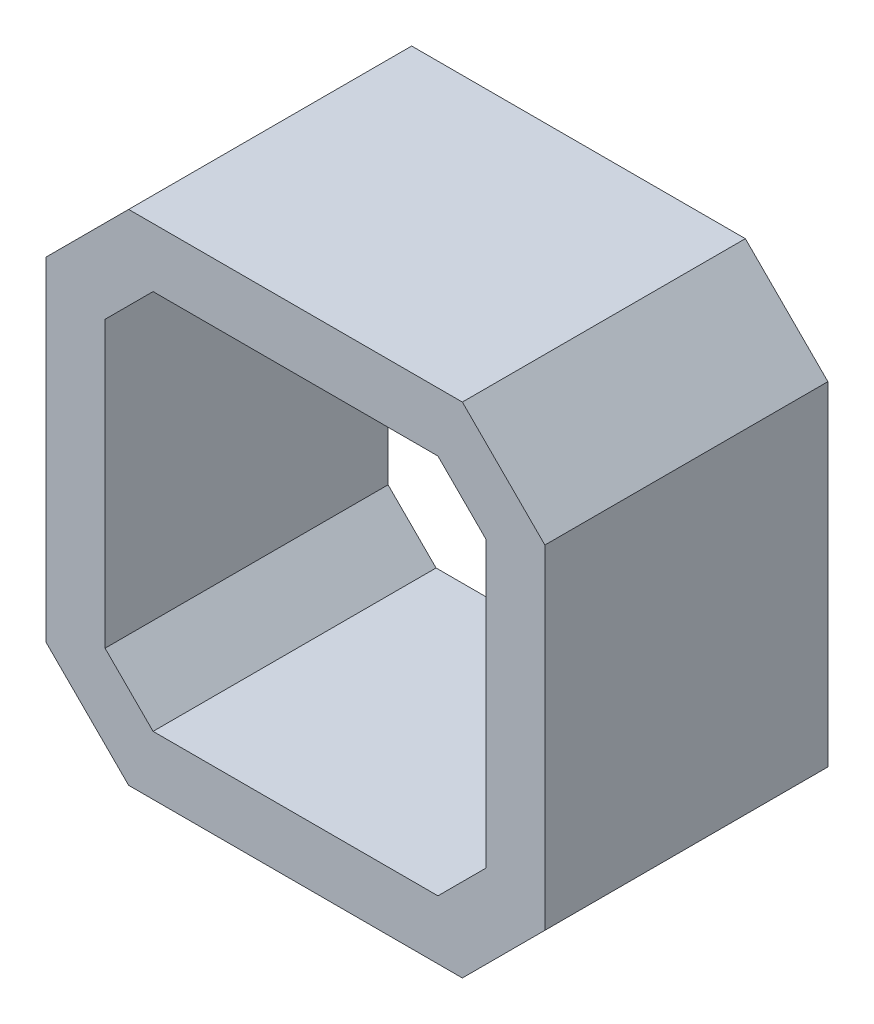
from build123d import *

# Parameters (mm, degrees)
BOSS_EXTRUDE1_DEPTH = 24


with BuildPart() as part:
    # Sketch1 → Boss-Extrude1 (new body)
    with BuildSketch(Plane.XY):
        Polygon((-14.15, 21.15), (-21.15, 14.15), (-21.15, -14.15), (-14.15, -21.15), (14.15, -21.15), (21.15, -14.15), (21.15, 14.15), (14.15, 21.15), align=None)
        Polygon((-12.078932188, 16.15), (12.078932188, 16.15), (16.15, 12.078932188), (16.15, -12.078932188), (12.078932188, -16.15), (-12.078932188, -16.15), (-16.15, -12.078932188), (-16.15, 12.078932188), align=None, mode=Mode.SUBTRACT)
    extrude(amount=BOSS_EXTRUDE1_DEPTH)


solid = part.part
